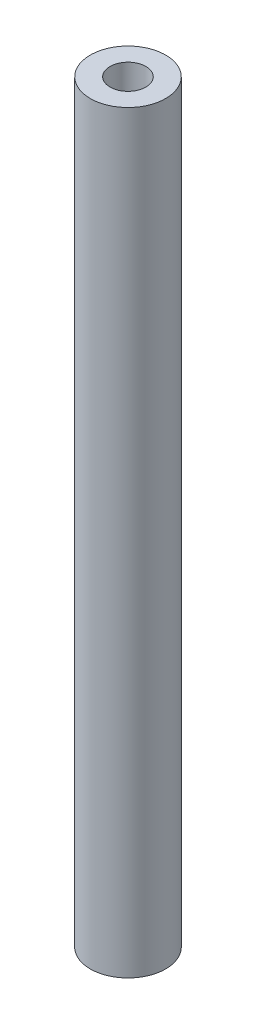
from build123d import *

# Parameters (mm, degrees)
SKIZZE1_R                       = 2
SKIZZE1_R_2                     = 0.95
AUFSATZ_LINEAR_AUSTRAGEN1_DEPTH = 20


with BuildPart() as part:
    # Skizze1 → Aufsatz-Linear austragen1 (new, symmetric)
    with BuildSketch(Plane(origin=(0, 0, 0), x_dir=(1, 0, 0), z_dir=(0, 1, 0))):
        with Locations(Location((0, 0, 0), (0, 0, 270))):
            Circle(SKIZZE1_R)
        with Locations(Location((0, 0, 0), (0, 0, 270))):
            Circle(SKIZZE1_R_2, mode=Mode.SUBTRACT)
    extrude(amount=AUFSATZ_LINEAR_AUSTRAGEN1_DEPTH, both=True)


solid = part.part
